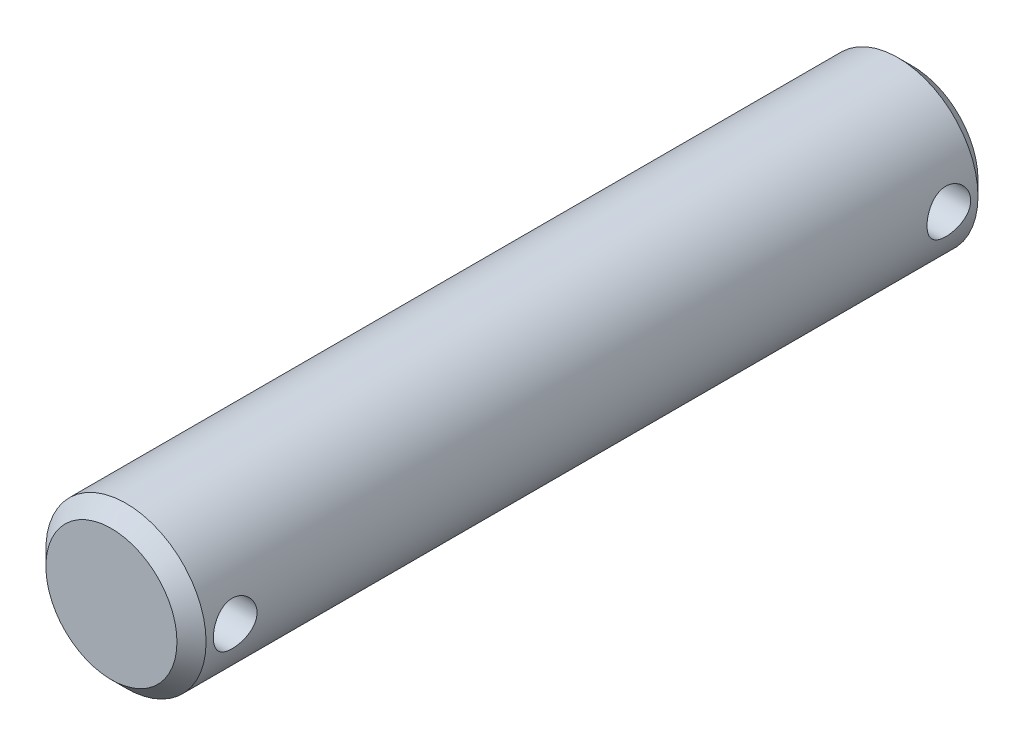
ISO-10303-21;
HEADER;
FILE_DESCRIPTION(('STEP AP214'),'2;1');
FILE_NAME('part.step','',(''),(''),'','','');
FILE_SCHEMA(('AUTOMOTIVE_DESIGN { 1 0 10303 214 1 1 1 1 }'));
ENDSEC;
DATA;
#1=APPLICATION_CONTEXT('core data for automotive mechanical design processes');
#2=APPLICATION_PROTOCOL_DEFINITION('international standard','automotive_design',2000,#1);
#3=PRODUCT_CONTEXT('',#1,'mechanical');
#4=PRODUCT('Part','Part','',(#3));
#5=PRODUCT_RELATED_PRODUCT_CATEGORY('part','',(#4));
#6=PRODUCT_DEFINITION_FORMATION('','',#4);
#7=PRODUCT_DEFINITION_CONTEXT('part definition',#1,'design');
#8=PRODUCT_DEFINITION('design','',#6,#7);
#9=PRODUCT_DEFINITION_SHAPE('','',#8);
#10=(LENGTH_UNIT() NAMED_UNIT(*) SI_UNIT(.MILLI.,.METRE.));
#11=(NAMED_UNIT(*) PLANE_ANGLE_UNIT() SI_UNIT($,.RADIAN.));
#12=(NAMED_UNIT(*) SI_UNIT($,.STERADIAN.) SOLID_ANGLE_UNIT());
#13=UNCERTAINTY_MEASURE_WITH_UNIT(LENGTH_MEASURE(1.E-05),#10,'distance_accuracy_value','');
#14=(GEOMETRIC_REPRESENTATION_CONTEXT(3) GLOBAL_UNCERTAINTY_ASSIGNED_CONTEXT((#13)) GLOBAL_UNIT_ASSIGNED_CONTEXT((#10,
#11,#12)) REPRESENTATION_CONTEXT('',''));
#15=CARTESIAN_POINT('',(0.,0.,0.));
#16=DIRECTION('',(0.,0.,1.));
#17=DIRECTION('',(1.,0.,0.));
#18=AXIS2_PLACEMENT_3D('',#15,#16,#17);
#19=CARTESIAN_POINT('',(0.,0.,-110.));
#20=DIRECTION('',(0.,0.,1.));
#21=DIRECTION('',(1.,0.,0.));
#22=AXIS2_PLACEMENT_3D('',#19,#20,#21);
#23=CYLINDRICAL_SURFACE('',#22,11.);
#24=CARTESIAN_POINT('',(11.,0.,-107.));
#25=CARTESIAN_POINT('',(10.9999976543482,0.165241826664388,-106.999996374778));
#26=CARTESIAN_POINT('',(10.9962401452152,0.330521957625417,-106.986301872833));
#27=CARTESIAN_POINT('',(10.981615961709,0.656311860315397,-106.931988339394));
#28=CARTESIAN_POINT('',(10.97074609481,0.816819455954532,-106.891357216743));
#29=CARTESIAN_POINT('',(10.9430954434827,1.12831525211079,-106.784596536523));
#30=CARTESIAN_POINT('',(10.9263224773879,1.27931573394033,-106.718500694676));
#31=CARTESIAN_POINT('',(10.888633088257,1.56808899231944,-106.562814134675));
#32=CARTESIAN_POINT('',(10.8677163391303,1.70586072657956,-106.473221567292));
#33=CARTESIAN_POINT('',(10.8234279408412,1.96759389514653,-106.270800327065));
#34=CARTESIAN_POINT('',(10.8000128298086,2.09119025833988,-106.157509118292));
#35=CARTESIAN_POINT('',(10.7536422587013,2.31788587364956,-105.91189472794));
#36=CARTESIAN_POINT('',(10.7306868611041,2.42098235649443,-105.779568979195));
#37=CARTESIAN_POINT('',(10.6873876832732,2.60555589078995,-105.496697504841));
#38=CARTESIAN_POINT('',(10.6670986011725,2.68660853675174,-105.345865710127));
#39=CARTESIAN_POINT('',(10.6320701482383,2.82205832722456,-105.032072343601));
#40=CARTESIAN_POINT('',(10.6173297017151,2.87646063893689,-104.869113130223));
#41=CARTESIAN_POINT('',(10.5955169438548,2.95578912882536,-104.539744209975));
#42=CARTESIAN_POINT('',(10.5882722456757,2.98137921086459,-104.373506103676));
#43=CARTESIAN_POINT('',(10.5817565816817,3.00442728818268,-104.038950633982));
#44=CARTESIAN_POINT('',(10.5824840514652,3.00189080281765,-103.870633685));
#45=CARTESIAN_POINT('',(10.5916764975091,2.96928383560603,-103.541916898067));
#46=CARTESIAN_POINT('',(10.5999143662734,2.94002147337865,-103.381429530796));
#47=CARTESIAN_POINT('',(10.6228351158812,2.85608967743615,-103.067733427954));
#48=CARTESIAN_POINT('',(10.6375185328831,2.80141813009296,-102.914525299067));
#49=CARTESIAN_POINT('',(10.6718723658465,2.66757259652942,-102.617652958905));
#50=CARTESIAN_POINT('',(10.6915991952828,2.58811903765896,-102.474121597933));
#51=CARTESIAN_POINT('',(10.7337873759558,2.40715976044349,-102.202147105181));
#52=CARTESIAN_POINT('',(10.756249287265,2.30564952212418,-102.073707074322));
#53=CARTESIAN_POINT('',(10.8023178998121,2.07934693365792,-101.830949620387));
#54=CARTESIAN_POINT('',(10.8259374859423,1.9538772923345,-101.717265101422));
#55=CARTESIAN_POINT('',(10.8709729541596,1.68536402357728,-101.512418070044));
#56=CARTESIAN_POINT('',(10.8923887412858,1.54231963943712,-101.421256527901));
#57=CARTESIAN_POINT('',(10.9307455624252,1.24170790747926,-101.26374665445));
#58=CARTESIAN_POINT('',(10.9476650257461,1.08407527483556,-101.197517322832));
#59=CARTESIAN_POINT('',(10.9749671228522,0.759345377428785,-101.092684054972));
#60=CARTESIAN_POINT('',(10.9853512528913,0.592250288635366,-101.054073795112));
#61=CARTESIAN_POINT('',(10.9981845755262,0.258736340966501,-101.006578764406));
#62=CARTESIAN_POINT('',(11.0008632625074,0.0924485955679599,-100.996834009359));
#63=CARTESIAN_POINT('',(10.9986460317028,-0.239386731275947,-101.004965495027));
#64=CARTESIAN_POINT('',(10.9937509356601,-0.404934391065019,-101.022838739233));
#65=CARTESIAN_POINT('',(10.977084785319,-0.727490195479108,-101.084995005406));
#66=CARTESIAN_POINT('',(10.965439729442,-0.884598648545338,-101.128794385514));
#67=CARTESIAN_POINT('',(10.9365984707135,-1.18921973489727,-101.240994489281));
#68=CARTESIAN_POINT('',(10.9194016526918,-1.33673130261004,-101.309397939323));
#69=CARTESIAN_POINT('',(10.8808314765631,-1.62128232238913,-101.470432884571));
#70=CARTESIAN_POINT('',(10.8593805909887,-1.75804920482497,-101.563526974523));
#71=CARTESIAN_POINT('',(10.8147797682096,-2.01432044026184,-101.770722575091));
#72=CARTESIAN_POINT('',(10.7916294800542,-2.13382121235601,-101.884828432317));
#73=CARTESIAN_POINT('',(10.7453880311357,-2.35582120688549,-102.134828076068));
#74=CARTESIAN_POINT('',(10.7223188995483,-2.45771255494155,-102.27126676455));
#75=CARTESIAN_POINT('',(10.6796005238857,-2.63717164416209,-102.559797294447));
#76=CARTESIAN_POINT('',(10.6599511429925,-2.71474035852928,-102.711888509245));
#77=CARTESIAN_POINT('',(10.6265249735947,-2.84277116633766,-103.026681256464));
#78=CARTESIAN_POINT('',(10.6127149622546,-2.89338704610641,-103.189316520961));
#79=CARTESIAN_POINT('',(10.5925362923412,-2.96641834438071,-103.521233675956));
#80=CARTESIAN_POINT('',(10.586165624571,-2.9888413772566,-103.690513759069));
#81=CARTESIAN_POINT('',(10.5817601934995,-3.00439791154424,-104.024676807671));
#82=CARTESIAN_POINT('',(10.5834467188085,-2.99851066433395,-104.189511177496));
#83=CARTESIAN_POINT('',(10.5943100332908,-2.95989675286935,-104.515741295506));
#84=CARTESIAN_POINT('',(10.6034866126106,-2.92717084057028,-104.677137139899));
#85=CARTESIAN_POINT('',(10.6281263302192,-2.8363881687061,-104.990612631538));
#86=CARTESIAN_POINT('',(10.6435356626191,-2.77854790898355,-105.14275950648));
#87=CARTESIAN_POINT('',(10.6789037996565,-2.63934609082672,-105.435306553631));
#88=CARTESIAN_POINT('',(10.6988633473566,-2.55798069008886,-105.575704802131));
#89=CARTESIAN_POINT('',(10.7418475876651,-2.37110861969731,-105.845421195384));
#90=CARTESIAN_POINT('',(10.7649475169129,-2.26493803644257,-105.974267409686));
#91=CARTESIAN_POINT('',(10.8111998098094,-2.0327202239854,-106.21263281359));
#92=CARTESIAN_POINT('',(10.834352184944,-1.90666811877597,-106.322147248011));
#93=CARTESIAN_POINT('',(10.8787291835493,-1.63481545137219,-106.521189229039));
#94=CARTESIAN_POINT('',(10.8998981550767,-1.48863173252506,-106.610206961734));
#95=CARTESIAN_POINT('',(10.9373052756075,-1.18279979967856,-106.762264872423));
#96=CARTESIAN_POINT('',(10.9535464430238,-1.02315990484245,-106.825320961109));
#97=CARTESIAN_POINT('',(10.9772838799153,-0.720200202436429,-106.915879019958));
#98=CARTESIAN_POINT('',(10.9857389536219,-0.578129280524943,-106.947349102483));
#99=CARTESIAN_POINT('',(10.9970977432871,-0.290715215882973,-106.989410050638));
#100=CARTESIAN_POINT('',(11.0000020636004,-0.145372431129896,-107.00000318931));
#101=CARTESIAN_POINT('',(11.,0.,-107.));
#102=B_SPLINE_CURVE_WITH_KNOTS('',3,(#24,#25,#26,#27,#28,#29,#30,#31,#32,#33,#34,#35,#36,#37,
#38,#39,#40,#41,#42,#43,#44,#45,#46,#47,#48,#49,#50,#51,#52,#53,#54,#55,#56,#57,#58,#59,#60,#61,
#62,#63,#64,#65,#66,#67,#68,#69,#70,#71,#72,#73,#74,#75,#76,#77,#78,#79,#80,#81,#82,#83,#84,#85,
#86,#87,#88,#89,#90,#91,#92,#93,#94,#95,#96,#97,#98,#99,#100,#101),.UNSPECIFIED.,.T.,.F.,(4,2,2,
2,2,2,2,2,2,2,2,2,2,2,2,2,2,2,2,2,2,2,2,2,2,2,2,2,2,2,2,2,2,2,2,2,2,2,4),(0.,0.495192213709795,
0.9906068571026,1.48536780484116,1.98016770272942,2.48571756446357,2.99133567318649,
3.5060918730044,4.02074822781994,4.52328609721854,5.02572535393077,5.51345773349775,
6.00123069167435,6.49471853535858,6.98830760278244,7.49877057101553,8.00925552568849,
8.52214699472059,9.03492099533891,9.53225622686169,10.029537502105,10.5178222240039,
11.0061610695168,11.5043893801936,12.0027208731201,12.5158014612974,13.0288615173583,
13.5389619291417,14.0489245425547,14.5413770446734,15.0338157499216,15.5220911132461,
16.0104462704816,16.5137802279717,17.0172378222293,17.532117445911,18.0466810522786,
18.4823766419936,18.9180247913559),.UNSPECIFIED.);
#103=CARTESIAN_POINT('',(11.,0.,-107.));
#104=VERTEX_POINT('',#103);
#105=EDGE_CURVE('E31',#104,#104,#102,.T.);
#106=ORIENTED_EDGE('',*,*,#105,.F.);
#107=EDGE_LOOP('',(#106));
#108=FACE_BOUND('',#107,.T.);
#109=CARTESIAN_POINT('',(-11.,0.,-107.));
#110=CARTESIAN_POINT('',(-10.9999976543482,-0.165241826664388,-106.999996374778));
#111=CARTESIAN_POINT('',(-10.9962401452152,-0.330521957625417,-106.986301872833));
#112=CARTESIAN_POINT('',(-10.981615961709,-0.656311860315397,-106.931988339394));
#113=CARTESIAN_POINT('',(-10.97074609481,-0.816819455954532,-106.891357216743));
#114=CARTESIAN_POINT('',(-10.9430954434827,-1.12831525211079,-106.784596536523));
#115=CARTESIAN_POINT('',(-10.9263224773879,-1.27931573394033,-106.718500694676));
#116=CARTESIAN_POINT('',(-10.888633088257,-1.56808899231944,-106.562814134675));
#117=CARTESIAN_POINT('',(-10.8677163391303,-1.70586072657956,-106.473221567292));
#118=CARTESIAN_POINT('',(-10.8234279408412,-1.96759389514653,-106.270800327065));
#119=CARTESIAN_POINT('',(-10.8000128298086,-2.09119025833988,-106.157509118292));
#120=CARTESIAN_POINT('',(-10.7536422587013,-2.31788587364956,-105.91189472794));
#121=CARTESIAN_POINT('',(-10.7306868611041,-2.42098235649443,-105.779568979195));
#122=CARTESIAN_POINT('',(-10.6873876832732,-2.60555589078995,-105.496697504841));
#123=CARTESIAN_POINT('',(-10.6670986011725,-2.68660853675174,-105.345865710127));
#124=CARTESIAN_POINT('',(-10.6320701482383,-2.82205832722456,-105.032072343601));
#125=CARTESIAN_POINT('',(-10.6173297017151,-2.87646063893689,-104.869113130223));
#126=CARTESIAN_POINT('',(-10.5955169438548,-2.95578912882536,-104.539744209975));
#127=CARTESIAN_POINT('',(-10.5882722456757,-2.98137921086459,-104.373506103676));
#128=CARTESIAN_POINT('',(-10.5817565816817,-3.00442728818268,-104.038950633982));
#129=CARTESIAN_POINT('',(-10.5824840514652,-3.00189080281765,-103.870633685));
#130=CARTESIAN_POINT('',(-10.5916764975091,-2.96928383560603,-103.541916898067));
#131=CARTESIAN_POINT('',(-10.5999143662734,-2.94002147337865,-103.381429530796));
#132=CARTESIAN_POINT('',(-10.6228351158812,-2.85608967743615,-103.067733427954));
#133=CARTESIAN_POINT('',(-10.6375185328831,-2.80141813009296,-102.914525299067));
#134=CARTESIAN_POINT('',(-10.6718723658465,-2.66757259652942,-102.617652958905));
#135=CARTESIAN_POINT('',(-10.6915991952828,-2.58811903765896,-102.474121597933));
#136=CARTESIAN_POINT('',(-10.7337873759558,-2.40715976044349,-102.202147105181));
#137=CARTESIAN_POINT('',(-10.756249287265,-2.30564952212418,-102.073707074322));
#138=CARTESIAN_POINT('',(-10.8023178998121,-2.07934693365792,-101.830949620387));
#139=CARTESIAN_POINT('',(-10.8259374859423,-1.9538772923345,-101.717265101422));
#140=CARTESIAN_POINT('',(-10.8709729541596,-1.68536402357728,-101.512418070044));
#141=CARTESIAN_POINT('',(-10.8923887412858,-1.54231963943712,-101.421256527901));
#142=CARTESIAN_POINT('',(-10.9307455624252,-1.24170790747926,-101.26374665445));
#143=CARTESIAN_POINT('',(-10.9476650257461,-1.08407527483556,-101.197517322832));
#144=CARTESIAN_POINT('',(-10.9749671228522,-0.759345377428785,-101.092684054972));
#145=CARTESIAN_POINT('',(-10.9853512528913,-0.592250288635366,-101.054073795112));
#146=CARTESIAN_POINT('',(-10.9981845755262,-0.258736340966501,-101.006578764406));
#147=CARTESIAN_POINT('',(-11.0008632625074,-0.0924485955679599,-100.996834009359));
#148=CARTESIAN_POINT('',(-10.9986460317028,0.239386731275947,-101.004965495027));
#149=CARTESIAN_POINT('',(-10.9937509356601,0.404934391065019,-101.022838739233));
#150=CARTESIAN_POINT('',(-10.977084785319,0.727490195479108,-101.084995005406));
#151=CARTESIAN_POINT('',(-10.965439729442,0.884598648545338,-101.128794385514));
#152=CARTESIAN_POINT('',(-10.9365984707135,1.18921973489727,-101.240994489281));
#153=CARTESIAN_POINT('',(-10.9194016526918,1.33673130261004,-101.309397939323));
#154=CARTESIAN_POINT('',(-10.8808314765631,1.62128232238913,-101.470432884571));
#155=CARTESIAN_POINT('',(-10.8593805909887,1.75804920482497,-101.563526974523));
#156=CARTESIAN_POINT('',(-10.8147797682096,2.01432044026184,-101.770722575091));
#157=CARTESIAN_POINT('',(-10.7916294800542,2.13382121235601,-101.884828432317));
#158=CARTESIAN_POINT('',(-10.7453880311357,2.35582120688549,-102.134828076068));
#159=CARTESIAN_POINT('',(-10.7223188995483,2.45771255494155,-102.27126676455));
#160=CARTESIAN_POINT('',(-10.6796005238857,2.63717164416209,-102.559797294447));
#161=CARTESIAN_POINT('',(-10.6599511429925,2.71474035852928,-102.711888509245));
#162=CARTESIAN_POINT('',(-10.6265249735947,2.84277116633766,-103.026681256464));
#163=CARTESIAN_POINT('',(-10.6127149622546,2.89338704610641,-103.189316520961));
#164=CARTESIAN_POINT('',(-10.5925362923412,2.96641834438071,-103.521233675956));
#165=CARTESIAN_POINT('',(-10.586165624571,2.9888413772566,-103.690513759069));
#166=CARTESIAN_POINT('',(-10.5817601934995,3.00439791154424,-104.024676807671));
#167=CARTESIAN_POINT('',(-10.5834467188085,2.99851066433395,-104.189511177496));
#168=CARTESIAN_POINT('',(-10.5943100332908,2.95989675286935,-104.515741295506));
#169=CARTESIAN_POINT('',(-10.6034866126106,2.92717084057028,-104.677137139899));
#170=CARTESIAN_POINT('',(-10.6281263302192,2.8363881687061,-104.990612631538));
#171=CARTESIAN_POINT('',(-10.6435356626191,2.77854790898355,-105.14275950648));
#172=CARTESIAN_POINT('',(-10.6789037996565,2.63934609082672,-105.435306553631));
#173=CARTESIAN_POINT('',(-10.6988633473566,2.55798069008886,-105.575704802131));
#174=CARTESIAN_POINT('',(-10.7418475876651,2.37110861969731,-105.845421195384));
#175=CARTESIAN_POINT('',(-10.7649475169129,2.26493803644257,-105.974267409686));
#176=CARTESIAN_POINT('',(-10.8111998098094,2.0327202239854,-106.21263281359));
#177=CARTESIAN_POINT('',(-10.834352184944,1.90666811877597,-106.322147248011));
#178=CARTESIAN_POINT('',(-10.8787291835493,1.63481545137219,-106.521189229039));
#179=CARTESIAN_POINT('',(-10.8998981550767,1.48863173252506,-106.610206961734));
#180=CARTESIAN_POINT('',(-10.9373052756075,1.18279979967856,-106.762264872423));
#181=CARTESIAN_POINT('',(-10.9535464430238,1.02315990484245,-106.825320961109));
#182=CARTESIAN_POINT('',(-10.9772838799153,0.720200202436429,-106.915879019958));
#183=CARTESIAN_POINT('',(-10.9857389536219,0.578129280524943,-106.947349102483));
#184=CARTESIAN_POINT('',(-10.9970977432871,0.290715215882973,-106.989410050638));
#185=CARTESIAN_POINT('',(-11.0000020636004,0.145372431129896,-107.00000318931));
#186=CARTESIAN_POINT('',(-11.,0.,-107.));
#187=B_SPLINE_CURVE_WITH_KNOTS('',3,(#109,#110,#111,#112,#113,#114,#115,#116,#117,#118,#119,
#120,#121,#122,#123,#124,#125,#126,#127,#128,#129,#130,#131,#132,#133,#134,#135,#136,#137,#138,
#139,#140,#141,#142,#143,#144,#145,#146,#147,#148,#149,#150,#151,#152,#153,#154,#155,#156,#157,
#158,#159,#160,#161,#162,#163,#164,#165,#166,#167,#168,#169,#170,#171,#172,#173,#174,#175,#176,
#177,#178,#179,#180,#181,#182,#183,#184,#185,#186),.UNSPECIFIED.,.T.,.F.,(4,2,2,2,2,2,2,2,2,2,2,
2,2,2,2,2,2,2,2,2,2,2,2,2,2,2,2,2,2,2,2,2,2,2,2,2,2,2,4),(0.,0.495192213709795,0.9906068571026,
1.48536780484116,1.98016770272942,2.48571756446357,2.99133567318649,3.5060918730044,
4.02074822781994,4.52328609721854,5.02572535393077,5.51345773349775,6.00123069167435,
6.49471853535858,6.98830760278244,7.49877057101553,8.00925552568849,8.52214699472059,
9.03492099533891,9.53225622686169,10.029537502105,10.5178222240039,11.0061610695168,
11.5043893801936,12.0027208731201,12.5158014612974,13.0288615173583,13.5389619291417,
14.0489245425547,14.5413770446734,15.0338157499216,15.5220911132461,16.0104462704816,
16.5137802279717,17.0172378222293,17.532117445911,18.0466810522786,18.4823766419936,
18.9180247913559),.UNSPECIFIED.);
#188=CARTESIAN_POINT('',(-11.,0.,-107.));
#189=VERTEX_POINT('',#188);
#190=EDGE_CURVE('E89',#189,#189,#187,.T.);
#191=ORIENTED_EDGE('',*,*,#190,.F.);
#192=EDGE_LOOP('',(#191));
#193=FACE_BOUND('',#192,.T.);
#194=CARTESIAN_POINT('',(11.,0.,-9.00000000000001));
#195=CARTESIAN_POINT('',(10.9999976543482,0.165241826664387,-8.99999637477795));
#196=CARTESIAN_POINT('',(10.9962401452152,0.330521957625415,-8.98630187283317));
#197=CARTESIAN_POINT('',(10.981615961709,0.656311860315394,-8.93198833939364));
#198=CARTESIAN_POINT('',(10.97074609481,0.816819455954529,-8.89135721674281));
#199=CARTESIAN_POINT('',(10.9430954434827,1.12831525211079,-8.78459653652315));
#200=CARTESIAN_POINT('',(10.9263224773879,1.27931573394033,-8.71850069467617));
#201=CARTESIAN_POINT('',(10.888633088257,1.56808899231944,-8.56281413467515));
#202=CARTESIAN_POINT('',(10.8677163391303,1.70586072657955,-8.47322156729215));
#203=CARTESIAN_POINT('',(10.8234279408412,1.96759389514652,-8.27080032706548));
#204=CARTESIAN_POINT('',(10.8000128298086,2.09119025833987,-8.15750911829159));
#205=CARTESIAN_POINT('',(10.7536422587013,2.31788587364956,-7.9118947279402));
#206=CARTESIAN_POINT('',(10.7306868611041,2.42098235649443,-7.77956897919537));
#207=CARTESIAN_POINT('',(10.6873876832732,2.60555589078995,-7.49669750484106));
#208=CARTESIAN_POINT('',(10.6670986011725,2.68660853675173,-7.34586571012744));
#209=CARTESIAN_POINT('',(10.6320701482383,2.82205832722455,-7.03207234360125));
#210=CARTESIAN_POINT('',(10.6173297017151,2.87646063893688,-6.86911313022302));
#211=CARTESIAN_POINT('',(10.5955169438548,2.95578912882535,-6.53974420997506));
#212=CARTESIAN_POINT('',(10.5882722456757,2.98137921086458,-6.37350610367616));
#213=CARTESIAN_POINT('',(10.5817565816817,3.00442728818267,-6.03895063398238));
#214=CARTESIAN_POINT('',(10.5824840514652,3.00189080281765,-5.87063368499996));
#215=CARTESIAN_POINT('',(10.5916764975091,2.96928383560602,-5.54191689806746));
#216=CARTESIAN_POINT('',(10.5999143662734,2.94002147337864,-5.38142953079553));
#217=CARTESIAN_POINT('',(10.6228351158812,2.85608967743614,-5.06773342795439));
#218=CARTESIAN_POINT('',(10.6375185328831,2.80141813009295,-4.91452529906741));
#219=CARTESIAN_POINT('',(10.6718723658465,2.6675725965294,-4.61765295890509));
#220=CARTESIAN_POINT('',(10.6915991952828,2.58811903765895,-4.47412159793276));
#221=CARTESIAN_POINT('',(10.7337873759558,2.40715976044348,-4.20214710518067));
#222=CARTESIAN_POINT('',(10.756249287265,2.30564952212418,-4.07370707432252));
#223=CARTESIAN_POINT('',(10.8023178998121,2.07934693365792,-3.83094962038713));
#224=CARTESIAN_POINT('',(10.8259374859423,1.9538772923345,-3.71726510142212));
#225=CARTESIAN_POINT('',(10.8709729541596,1.68536402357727,-3.51241807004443));
#226=CARTESIAN_POINT('',(10.8923887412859,1.54231963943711,-3.42125652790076));
#227=CARTESIAN_POINT('',(10.9307455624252,1.24170790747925,-3.26374665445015));
#228=CARTESIAN_POINT('',(10.9476650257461,1.08407527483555,-3.19751732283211));
#229=CARTESIAN_POINT('',(10.9749671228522,0.759345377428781,-3.09268405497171));
#230=CARTESIAN_POINT('',(10.9853512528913,0.592250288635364,-3.05407379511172));
#231=CARTESIAN_POINT('',(10.9981845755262,0.258736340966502,-3.00657876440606));
#232=CARTESIAN_POINT('',(11.0008632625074,0.092448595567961,-2.99683400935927));
#233=CARTESIAN_POINT('',(10.9986460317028,-0.239386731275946,-3.00496549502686));
#234=CARTESIAN_POINT('',(10.9937509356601,-0.404934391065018,-3.02283873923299));
#235=CARTESIAN_POINT('',(10.977084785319,-0.727490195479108,-3.08499500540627));
#236=CARTESIAN_POINT('',(10.965439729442,-0.884598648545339,-3.12879438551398));
#237=CARTESIAN_POINT('',(10.9365984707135,-1.18921973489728,-3.24099448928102));
#238=CARTESIAN_POINT('',(10.9194016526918,-1.33673130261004,-3.30939793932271));
#239=CARTESIAN_POINT('',(10.8808314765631,-1.62128232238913,-3.47043288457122));
#240=CARTESIAN_POINT('',(10.8593805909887,-1.75804920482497,-3.56352697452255));
#241=CARTESIAN_POINT('',(10.8147797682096,-2.01432044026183,-3.77072257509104));
#242=CARTESIAN_POINT('',(10.7916294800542,-2.133821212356,-3.88482843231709));
#243=CARTESIAN_POINT('',(10.7453880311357,-2.35582120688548,-4.13482807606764));
#244=CARTESIAN_POINT('',(10.7223188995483,-2.45771255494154,-4.27126676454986));
#245=CARTESIAN_POINT('',(10.6796005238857,-2.63717164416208,-4.55979729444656));
#246=CARTESIAN_POINT('',(10.6599511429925,-2.71474035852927,-4.71188850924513));
#247=CARTESIAN_POINT('',(10.6265249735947,-2.84277116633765,-5.02668125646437));
#248=CARTESIAN_POINT('',(10.6127149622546,-2.8933870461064,-5.18931652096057));
#249=CARTESIAN_POINT('',(10.5925362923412,-2.9664183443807,-5.52123367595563));
#250=CARTESIAN_POINT('',(10.586165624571,-2.98884137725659,-5.69051375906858));
#251=CARTESIAN_POINT('',(10.5817601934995,-3.00439791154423,-6.02467680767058));
#252=CARTESIAN_POINT('',(10.5834467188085,-2.99851066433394,-6.18951117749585));
#253=CARTESIAN_POINT('',(10.5943100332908,-2.95989675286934,-6.51574129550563));
#254=CARTESIAN_POINT('',(10.6034866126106,-2.92717084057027,-6.67713713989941));
#255=CARTESIAN_POINT('',(10.6281263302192,-2.83638816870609,-6.99061263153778));
#256=CARTESIAN_POINT('',(10.6435356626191,-2.77854790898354,-7.14275950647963));
#257=CARTESIAN_POINT('',(10.6789037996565,-2.63934609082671,-7.43530655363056));
#258=CARTESIAN_POINT('',(10.6988633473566,-2.55798069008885,-7.57570480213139));
#259=CARTESIAN_POINT('',(10.7418475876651,-2.37110861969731,-7.84542119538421));
#260=CARTESIAN_POINT('',(10.7649475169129,-2.26493803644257,-7.97426740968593));
#261=CARTESIAN_POINT('',(10.8111998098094,-2.0327202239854,-8.2126328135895));
#262=CARTESIAN_POINT('',(10.834352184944,-1.90666811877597,-8.32214724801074));
#263=CARTESIAN_POINT('',(10.8787291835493,-1.63481545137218,-8.52118922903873));
#264=CARTESIAN_POINT('',(10.8998981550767,-1.48863173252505,-8.61020696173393));
#265=CARTESIAN_POINT('',(10.9373052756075,-1.18279979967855,-8.76226487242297));
#266=CARTESIAN_POINT('',(10.9535464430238,-1.02315990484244,-8.82532096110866));
#267=CARTESIAN_POINT('',(10.9772838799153,-0.720200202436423,-8.91587901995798));
#268=CARTESIAN_POINT('',(10.9857389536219,-0.578129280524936,-8.9473491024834));
#269=CARTESIAN_POINT('',(10.9970977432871,-0.290715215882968,-8.98941005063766));
#270=CARTESIAN_POINT('',(11.0000020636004,-0.145372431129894,-9.0000031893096));
#271=CARTESIAN_POINT('',(11.,0.,-9.00000000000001));
#272=B_SPLINE_CURVE_WITH_KNOTS('',3,(#194,#195,#196,#197,#198,#199,#200,#201,#202,#203,#204,
#205,#206,#207,#208,#209,#210,#211,#212,#213,#214,#215,#216,#217,#218,#219,#220,#221,#222,#223,
#224,#225,#226,#227,#228,#229,#230,#231,#232,#233,#234,#235,#236,#237,#238,#239,#240,#241,#242,
#243,#244,#245,#246,#247,#248,#249,#250,#251,#252,#253,#254,#255,#256,#257,#258,#259,#260,#261,
#262,#263,#264,#265,#266,#267,#268,#269,#270,#271),.UNSPECIFIED.,.T.,.F.,(4,2,2,2,2,2,2,2,2,2,2,
2,2,2,2,2,2,2,2,2,2,2,2,2,2,2,2,2,2,2,2,2,2,2,2,2,2,2,4),(0.,0.495192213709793,0.9906068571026,
1.48536780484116,1.98016770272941,2.48571756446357,2.99133567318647,3.50609187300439,
4.02074822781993,4.52328609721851,5.02572535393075,5.51345773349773,6.00123069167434,
6.49471853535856,6.98830760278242,7.4987705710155,8.00925552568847,8.52214699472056,
9.03492099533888,9.53225622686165,10.029537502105,10.5178222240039,11.0061610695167,
11.5043893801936,12.0027208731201,12.5158014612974,13.0288615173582,13.5389619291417,
14.0489245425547,14.5413770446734,15.0338157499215,15.5220911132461,16.0104462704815,
16.5137802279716,17.0172378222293,17.5321174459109,18.0466810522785,18.4823766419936,
18.9180247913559),.UNSPECIFIED.);
#273=CARTESIAN_POINT('',(11.,0.,-9.00000000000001));
#274=VERTEX_POINT('',#273);
#275=EDGE_CURVE('E53',#274,#274,#272,.T.);
#276=ORIENTED_EDGE('',*,*,#275,.F.);
#277=EDGE_LOOP('',(#276));
#278=FACE_BOUND('',#277,.T.);
#279=CARTESIAN_POINT('',(-11.,0.,-9.));
#280=CARTESIAN_POINT('',(-10.9999976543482,-0.165241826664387,-8.99999637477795));
#281=CARTESIAN_POINT('',(-10.9962401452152,-0.330521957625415,-8.98630187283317));
#282=CARTESIAN_POINT('',(-10.981615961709,-0.656311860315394,-8.93198833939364));
#283=CARTESIAN_POINT('',(-10.97074609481,-0.816819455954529,-8.89135721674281));
#284=CARTESIAN_POINT('',(-10.9430954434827,-1.12831525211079,-8.78459653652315));
#285=CARTESIAN_POINT('',(-10.9263224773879,-1.27931573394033,-8.71850069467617));
#286=CARTESIAN_POINT('',(-10.888633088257,-1.56808899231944,-8.56281413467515));
#287=CARTESIAN_POINT('',(-10.8677163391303,-1.70586072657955,-8.47322156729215));
#288=CARTESIAN_POINT('',(-10.8234279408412,-1.96759389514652,-8.27080032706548));
#289=CARTESIAN_POINT('',(-10.8000128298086,-2.09119025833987,-8.15750911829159));
#290=CARTESIAN_POINT('',(-10.7536422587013,-2.31788587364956,-7.9118947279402));
#291=CARTESIAN_POINT('',(-10.7306868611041,-2.42098235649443,-7.77956897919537));
#292=CARTESIAN_POINT('',(-10.6873876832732,-2.60555589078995,-7.49669750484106));
#293=CARTESIAN_POINT('',(-10.6670986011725,-2.68660853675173,-7.34586571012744));
#294=CARTESIAN_POINT('',(-10.6320701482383,-2.82205832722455,-7.03207234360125));
#295=CARTESIAN_POINT('',(-10.6173297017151,-2.87646063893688,-6.86911313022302));
#296=CARTESIAN_POINT('',(-10.5955169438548,-2.95578912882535,-6.53974420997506));
#297=CARTESIAN_POINT('',(-10.5882722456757,-2.98137921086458,-6.37350610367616));
#298=CARTESIAN_POINT('',(-10.5817565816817,-3.00442728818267,-6.03895063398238));
#299=CARTESIAN_POINT('',(-10.5824840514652,-3.00189080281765,-5.87063368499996));
#300=CARTESIAN_POINT('',(-10.5916764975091,-2.96928383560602,-5.54191689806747));
#301=CARTESIAN_POINT('',(-10.5999143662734,-2.94002147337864,-5.38142953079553));
#302=CARTESIAN_POINT('',(-10.6228351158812,-2.85608967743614,-5.06773342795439));
#303=CARTESIAN_POINT('',(-10.6375185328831,-2.80141813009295,-4.91452529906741));
#304=CARTESIAN_POINT('',(-10.6718723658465,-2.66757259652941,-4.61765295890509));
#305=CARTESIAN_POINT('',(-10.6915991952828,-2.58811903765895,-4.47412159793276));
#306=CARTESIAN_POINT('',(-10.7337873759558,-2.40715976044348,-4.20214710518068));
#307=CARTESIAN_POINT('',(-10.756249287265,-2.30564952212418,-4.07370707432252));
#308=CARTESIAN_POINT('',(-10.8023178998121,-2.07934693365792,-3.83094962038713));
#309=CARTESIAN_POINT('',(-10.8259374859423,-1.9538772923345,-3.71726510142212));
#310=CARTESIAN_POINT('',(-10.8709729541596,-1.68536402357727,-3.51241807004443));
#311=CARTESIAN_POINT('',(-10.8923887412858,-1.54231963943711,-3.42125652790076));
#312=CARTESIAN_POINT('',(-10.9307455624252,-1.24170790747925,-3.26374665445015));
#313=CARTESIAN_POINT('',(-10.9476650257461,-1.08407527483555,-3.19751732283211));
#314=CARTESIAN_POINT('',(-10.9749671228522,-0.759345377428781,-3.09268405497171));
#315=CARTESIAN_POINT('',(-10.9853512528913,-0.592250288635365,-3.05407379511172));
#316=CARTESIAN_POINT('',(-10.9981845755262,-0.258736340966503,-3.00657876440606));
#317=CARTESIAN_POINT('',(-11.0008632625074,-0.0924485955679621,-2.99683400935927));
#318=CARTESIAN_POINT('',(-10.9986460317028,0.239386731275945,-3.00496549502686));
#319=CARTESIAN_POINT('',(-10.9937509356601,0.404934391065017,-3.02283873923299));
#320=CARTESIAN_POINT('',(-10.977084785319,0.727490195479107,-3.08499500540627));
#321=CARTESIAN_POINT('',(-10.965439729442,0.884598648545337,-3.12879438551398));
#322=CARTESIAN_POINT('',(-10.9365984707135,1.18921973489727,-3.24099448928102));
#323=CARTESIAN_POINT('',(-10.9194016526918,1.33673130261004,-3.30939793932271));
#324=CARTESIAN_POINT('',(-10.8808314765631,1.62128232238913,-3.47043288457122));
#325=CARTESIAN_POINT('',(-10.8593805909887,1.75804920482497,-3.56352697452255));
#326=CARTESIAN_POINT('',(-10.8147797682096,2.01432044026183,-3.77072257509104));
#327=CARTESIAN_POINT('',(-10.7916294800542,2.133821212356,-3.88482843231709));
#328=CARTESIAN_POINT('',(-10.7453880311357,2.35582120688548,-4.13482807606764));
#329=CARTESIAN_POINT('',(-10.7223188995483,2.45771255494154,-4.27126676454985));
#330=CARTESIAN_POINT('',(-10.6796005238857,2.63717164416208,-4.55979729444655));
#331=CARTESIAN_POINT('',(-10.6599511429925,2.71474035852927,-4.71188850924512));
#332=CARTESIAN_POINT('',(-10.6265249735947,2.84277116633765,-5.02668125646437));
#333=CARTESIAN_POINT('',(-10.6127149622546,2.8933870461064,-5.18931652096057));
#334=CARTESIAN_POINT('',(-10.5925362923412,2.9664183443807,-5.52123367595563));
#335=CARTESIAN_POINT('',(-10.586165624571,2.98884137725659,-5.69051375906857));
#336=CARTESIAN_POINT('',(-10.5817601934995,3.00439791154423,-6.02467680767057));
#337=CARTESIAN_POINT('',(-10.5834467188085,2.99851066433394,-6.18951117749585));
#338=CARTESIAN_POINT('',(-10.5943100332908,2.95989675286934,-6.51574129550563));
#339=CARTESIAN_POINT('',(-10.6034866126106,2.92717084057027,-6.67713713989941));
#340=CARTESIAN_POINT('',(-10.6281263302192,2.83638816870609,-6.99061263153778));
#341=CARTESIAN_POINT('',(-10.6435356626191,2.77854790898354,-7.14275950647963));
#342=CARTESIAN_POINT('',(-10.6789037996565,2.63934609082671,-7.43530655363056));
#343=CARTESIAN_POINT('',(-10.6988633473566,2.55798069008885,-7.57570480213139));
#344=CARTESIAN_POINT('',(-10.7418475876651,2.37110861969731,-7.84542119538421));
#345=CARTESIAN_POINT('',(-10.7649475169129,2.26493803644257,-7.97426740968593));
#346=CARTESIAN_POINT('',(-10.8111998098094,2.0327202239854,-8.2126328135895));
#347=CARTESIAN_POINT('',(-10.834352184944,1.90666811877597,-8.32214724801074));
#348=CARTESIAN_POINT('',(-10.8787291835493,1.63481545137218,-8.52118922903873));
#349=CARTESIAN_POINT('',(-10.8998981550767,1.48863173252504,-8.61020696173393));
#350=CARTESIAN_POINT('',(-10.9373052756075,1.18279979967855,-8.76226487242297));
#351=CARTESIAN_POINT('',(-10.9535464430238,1.02315990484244,-8.82532096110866));
#352=CARTESIAN_POINT('',(-10.9772838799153,0.720200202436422,-8.91587901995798));
#353=CARTESIAN_POINT('',(-10.9857389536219,0.578129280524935,-8.9473491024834));
#354=CARTESIAN_POINT('',(-10.9970977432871,0.290715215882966,-8.98941005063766));
#355=CARTESIAN_POINT('',(-11.0000020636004,0.145372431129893,-9.0000031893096));
#356=CARTESIAN_POINT('',(-11.,0.,-9.));
#357=B_SPLINE_CURVE_WITH_KNOTS('',3,(#279,#280,#281,#282,#283,#284,#285,#286,#287,#288,#289,
#290,#291,#292,#293,#294,#295,#296,#297,#298,#299,#300,#301,#302,#303,#304,#305,#306,#307,#308,
#309,#310,#311,#312,#313,#314,#315,#316,#317,#318,#319,#320,#321,#322,#323,#324,#325,#326,#327,
#328,#329,#330,#331,#332,#333,#334,#335,#336,#337,#338,#339,#340,#341,#342,#343,#344,#345,#346,
#347,#348,#349,#350,#351,#352,#353,#354,#355,#356),.UNSPECIFIED.,.T.,.F.,(4,2,2,2,2,2,2,2,2,2,2,
2,2,2,2,2,2,2,2,2,2,2,2,2,2,2,2,2,2,2,2,2,2,2,2,2,2,2,4),(0.,0.495192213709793,
0.990606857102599,1.48536780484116,1.98016770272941,2.48571756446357,2.99133567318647,
3.50609187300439,4.02074822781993,4.52328609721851,5.02572535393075,5.51345773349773,
6.00123069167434,6.49471853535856,6.98830760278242,7.4987705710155,8.00925552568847,
8.52214699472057,9.03492099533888,9.53225622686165,10.029537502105,10.5178222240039,
11.0061610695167,11.5043893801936,12.0027208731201,12.5158014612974,13.0288615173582,
13.5389619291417,14.0489245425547,14.5413770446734,15.0338157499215,15.5220911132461,
16.0104462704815,16.5137802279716,17.0172378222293,17.5321174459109,18.0466810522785,
18.4823766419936,18.9180247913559),.UNSPECIFIED.);
#358=CARTESIAN_POINT('',(-11.,0.,-9.));
#359=VERTEX_POINT('',#358);
#360=EDGE_CURVE('E47',#359,#359,#357,.T.);
#361=ORIENTED_EDGE('',*,*,#360,.F.);
#362=EDGE_LOOP('',(#361));
#363=FACE_BOUND('',#362,.T.);
#364=CARTESIAN_POINT('',(0.,0.,-2.));
#365=DIRECTION('',(0.,0.,1.));
#366=DIRECTION('',(1.,0.,0.));
#367=AXIS2_PLACEMENT_3D('',#364,#365,#366);
#368=CIRCLE('',#367,11.);
#369=CARTESIAN_POINT('',(11.,0.,-2.));
#370=VERTEX_POINT('',#369);
#371=EDGE_CURVE('E38',#370,#370,#368,.F.);
#372=ORIENTED_EDGE('',*,*,#371,.T.);
#373=EDGE_LOOP('',(#372));
#374=FACE_BOUND('',#373,.T.);
#375=CARTESIAN_POINT('',(0.,0.,-108.));
#376=DIRECTION('',(0.,0.,1.));
#377=DIRECTION('',(1.,0.,0.));
#378=AXIS2_PLACEMENT_3D('',#375,#376,#377);
#379=CIRCLE('',#378,11.);
#380=CARTESIAN_POINT('',(11.,0.,-108.));
#381=VERTEX_POINT('',#380);
#382=EDGE_CURVE('E43',#381,#381,#379,.T.);
#383=ORIENTED_EDGE('',*,*,#382,.T.);
#384=EDGE_LOOP('',(#383));
#385=FACE_BOUND('',#384,.T.);
#386=ADVANCED_FACE('F27',(#108,#193,#278,#363,#374,#385),#23,.T.);
#387=CARTESIAN_POINT('',(0.,0.,-110.));
#388=DIRECTION('',(0.,0.,1.));
#389=DIRECTION('',(1.,0.,0.));
#390=AXIS2_PLACEMENT_3D('',#387,#388,#389);
#391=PLANE('',#390);
#392=CARTESIAN_POINT('',(0.,0.,-110.));
#393=DIRECTION('',(0.,0.,1.));
#394=DIRECTION('',(1.,0.,0.));
#395=AXIS2_PLACEMENT_3D('',#392,#393,#394);
#396=CIRCLE('',#395,8.99999999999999);
#397=CARTESIAN_POINT('',(8.99999999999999,0.,-110.));
#398=VERTEX_POINT('',#397);
#399=EDGE_CURVE('E10',#398,#398,#396,.F.);
#400=ORIENTED_EDGE('',*,*,#399,.T.);
#401=EDGE_LOOP('',(#400));
#402=FACE_BOUND('',#401,.T.);
#403=ADVANCED_FACE('F74',(#402),#391,.F.);
#404=CARTESIAN_POINT('',(0.,0.,0.));
#405=DIRECTION('',(0.,0.,1.));
#406=DIRECTION('',(1.,0.,0.));
#407=AXIS2_PLACEMENT_3D('',#404,#405,#406);
#408=PLANE('',#407);
#409=CARTESIAN_POINT('',(0.,0.,0.));
#410=DIRECTION('',(0.,0.,1.));
#411=DIRECTION('',(1.,0.,0.));
#412=AXIS2_PLACEMENT_3D('',#409,#410,#411);
#413=CIRCLE('',#412,9.00000000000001);
#414=CARTESIAN_POINT('',(9.00000000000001,0.,0.));
#415=VERTEX_POINT('',#414);
#416=EDGE_CURVE('E100',#415,#415,#413,.T.);
#417=ORIENTED_EDGE('',*,*,#416,.T.);
#418=EDGE_LOOP('',(#417));
#419=FACE_BOUND('',#418,.T.);
#420=ADVANCED_FACE('F71',(#419),#408,.T.);
#421=CARTESIAN_POINT('',(0.,0.,0.));
#422=DIRECTION('',(0.,0.,-1.));
#423=DIRECTION('',(-1.,0.,0.));
#424=AXIS2_PLACEMENT_3D('',#421,#422,#423);
#425=CONICAL_SURFACE('',#424,9.00000000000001,0.785398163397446);
#426=ORIENTED_EDGE('',*,*,#371,.F.);
#427=EDGE_LOOP('',(#426));
#428=FACE_BOUND('',#427,.T.);
#429=ORIENTED_EDGE('',*,*,#416,.F.);
#430=EDGE_LOOP('',(#429));
#431=FACE_BOUND('',#430,.T.);
#432=ADVANCED_FACE('F67',(#428,#431),#425,.T.);
#433=CARTESIAN_POINT('',(0.,0.,-108.));
#434=DIRECTION('',(0.,0.,1.));
#435=DIRECTION('',(1.,0.,0.));
#436=AXIS2_PLACEMENT_3D('',#433,#434,#435);
#437=CONICAL_SURFACE('',#436,11.,0.785398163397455);
#438=ORIENTED_EDGE('',*,*,#399,.F.);
#439=EDGE_LOOP('',(#438));
#440=FACE_BOUND('',#439,.T.);
#441=ORIENTED_EDGE('',*,*,#382,.F.);
#442=EDGE_LOOP('',(#441));
#443=FACE_BOUND('',#442,.T.);
#444=ADVANCED_FACE('F61',(#440,#443),#437,.T.);
#445=CARTESIAN_POINT('',(-50.,0.,-6.));
#446=DIRECTION('',(1.,0.,0.));
#447=DIRECTION('',(0.,0.,-1.));
#448=AXIS2_PLACEMENT_3D('',#445,#446,#447);
#449=CYLINDRICAL_SURFACE('',#448,3.);
#450=ORIENTED_EDGE('',*,*,#275,.T.);
#451=EDGE_LOOP('',(#450));
#452=FACE_BOUND('',#451,.T.);
#453=ORIENTED_EDGE('',*,*,#360,.T.);
#454=EDGE_LOOP('',(#453));
#455=FACE_BOUND('',#454,.T.);
#456=ADVANCED_FACE('F56',(#452,#455),#449,.F.);
#457=CARTESIAN_POINT('',(-50.,0.,-104.));
#458=DIRECTION('',(1.,0.,0.));
#459=DIRECTION('',(0.,0.,-1.));
#460=AXIS2_PLACEMENT_3D('',#457,#458,#459);
#461=CYLINDRICAL_SURFACE('',#460,3.00000000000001);
#462=ORIENTED_EDGE('',*,*,#105,.T.);
#463=EDGE_LOOP('',(#462));
#464=FACE_BOUND('',#463,.T.);
#465=ORIENTED_EDGE('',*,*,#190,.T.);
#466=EDGE_LOOP('',(#465));
#467=FACE_BOUND('',#466,.T.);
#468=ADVANCED_FACE('F60',(#464,#467),#461,.F.);
#469=CLOSED_SHELL('',(#386,#403,#420,#432,#444,#456,#468));
#470=MANIFOLD_SOLID_BREP('B2',#469);
#471=ADVANCED_BREP_SHAPE_REPRESENTATION('',(#18,#470),#14);
#472=SHAPE_DEFINITION_REPRESENTATION(#9,#471);
ENDSEC;
END-ISO-10303-21;
